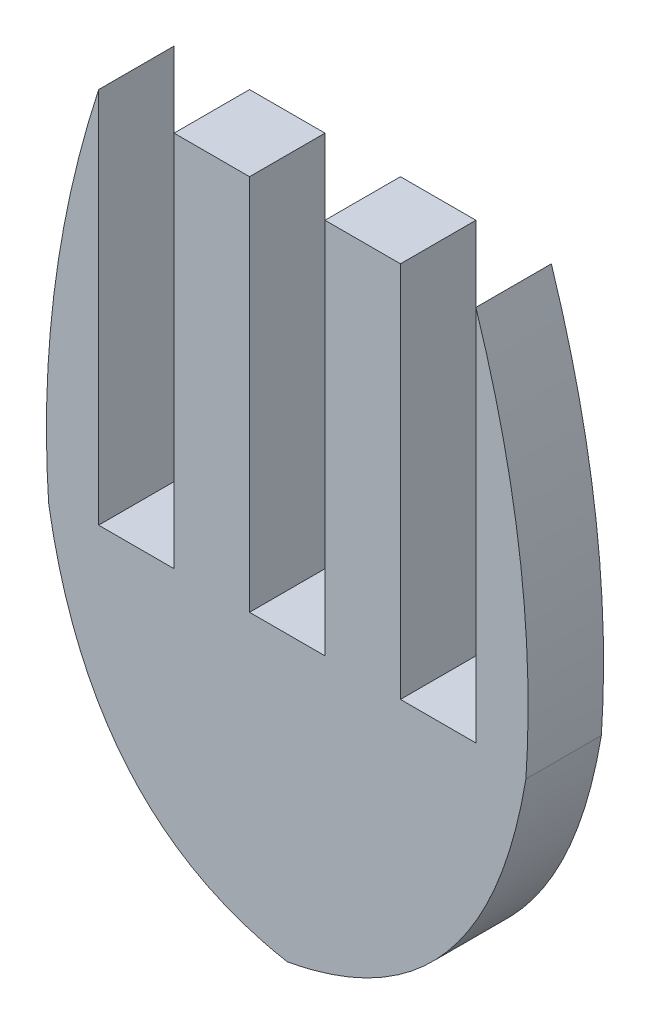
from build123d import *

# Parameters (mm, degrees)
SALIENTE_EXTRUIR1_DEPTH = 3


with BuildPart() as part:
    # Croquis1 → Saliente-Extruir1 (new body)
    with BuildSketch(Plane.XY):
        with BuildLine():
            Line((-7.03477586, 17.2979396), (-7.03477586, 2.2979396))
            Line((-7.03477586, 2.2979396), (-4.03477586, 2.2979396))
            Line((-4.03477586, 2.2979396), (-4.03477586, 17.2979396))
            Line((-4.03477586, 17.2979396), (-1.03477586, 17.2979396))
            Line((-1.03477586, 17.2979396), (-1.03477586, 2.2979396))
            Line((-1.03477586, 2.2979396), (1.96522414, 2.2979396))
            Line((1.96522414, 2.2979396), (1.96522414, 17.2979396))
            Line((1.96522414, 17.2979396), (4.96522414, 17.2979396))
            Line((4.96522414, 17.2979396), (4.96522414, 2.2979396))
            Line((4.96522414, 2.2979396), (7.96522414, 2.2979396))
            Line((7.96522414, 2.2979396), (7.96522414, 17.2979396))
            add(Edge.make_bspline(
                [(7.96522414, 17.2979396), (10.465449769, 9.555468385), (9.95323128, 2.049651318)],
                knots=[0, 0, 0, 0.8834945, 0.8834945, 0.8834945], degree=2))
            add(Edge.make_bspline(
                [(9.95323128, 2.049651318), (8.337083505, -7.564430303), (0.46522414, -8.987330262)],
                knots=[0, 0, 0, 1, 1, 1], degree=2))
            add(Edge.make_bspline(
                [(-9.022783, 2.049651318), (-7.406635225, -7.564430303), (0.46522414, -8.987330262)],
                knots=[0, 0, 0, 1, 1, 1], degree=2))
            add(Edge.make_bspline(
                [(-7.03477586, 17.2979396), (-9.53500149, 9.555468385), (-9.022783, 2.049651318)],
                knots=[0, 0, 0, 0.8834945, 0.8834945, 0.8834945], degree=2))
        make_face()
    extrude(amount=SALIENTE_EXTRUIR1_DEPTH)


solid = part.part
